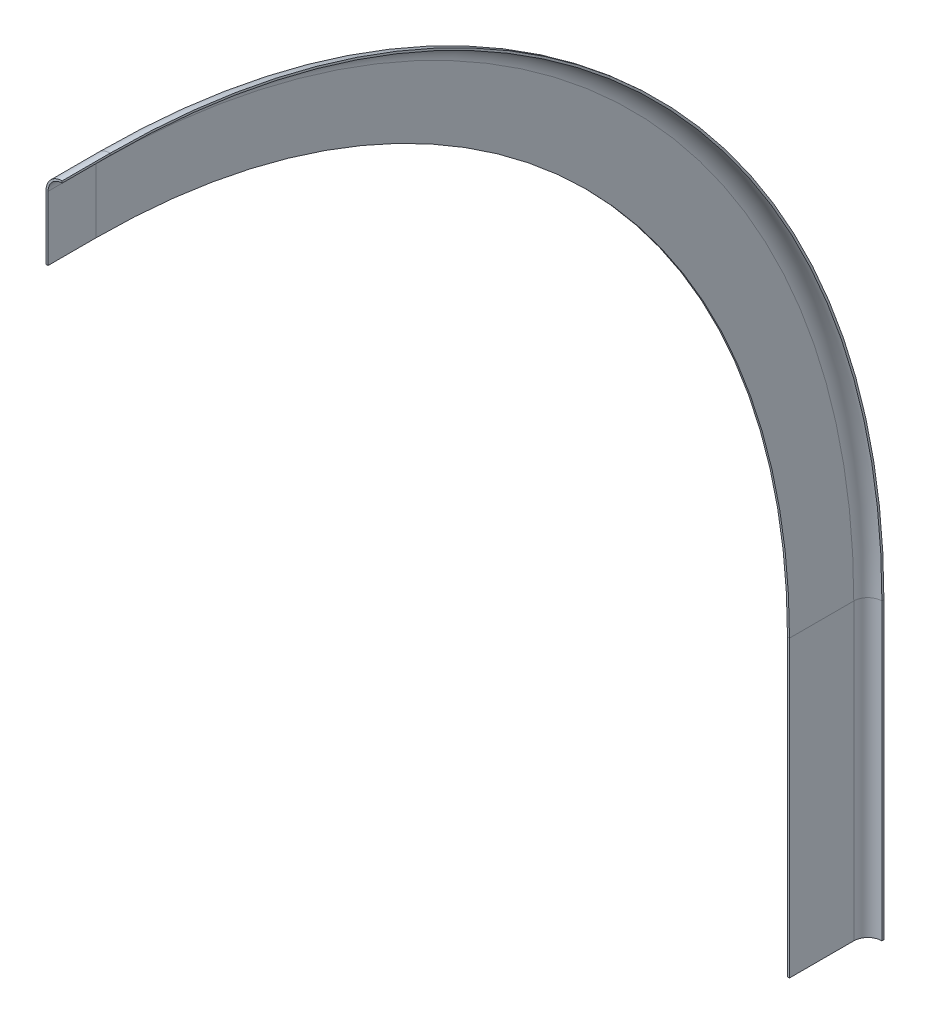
from build123d import *


with BuildPart() as part:
    # Sweep1: sweep along a path in Curve Path
    with BuildLine(Plane.YZ) as sweep1_path:
        Line((-844.7111, -648.5125), (-379.5689, -648.5125))
        ThreePointArc((-379.5689, -648.5125), (485.005258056, -290.394158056), (843.1236, 574.18))
        Line((843.1236, 574.18), (843.1236, 650.1))
    # Body → Sweep1 (sweep)
    with BuildSketch(Plane(origin=(0, -844.7111, 0), x_dir=(-1, 0, 0), z_dir=(0, 1, 0))):
        with BuildLine():
            Line((118.11, -623.1125), (118.11, -521.5125))
            Line((118.11, -521.5125), (114.935, -521.5125))
            Line((114.935, -521.5125), (114.935, -623.1125))
            ThreePointArc((114.935, -623.1125), (108.425448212, -638.827948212), (92.71, -645.3375))
            Line((92.71, -645.3375), (92.71, -648.5125))
            ThreePointArc((92.71, -648.5125), (110.670512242, -641.073012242), (118.11, -623.1125))
        make_face()
    sweep(path=sweep1_path.line)


solid = part.part
